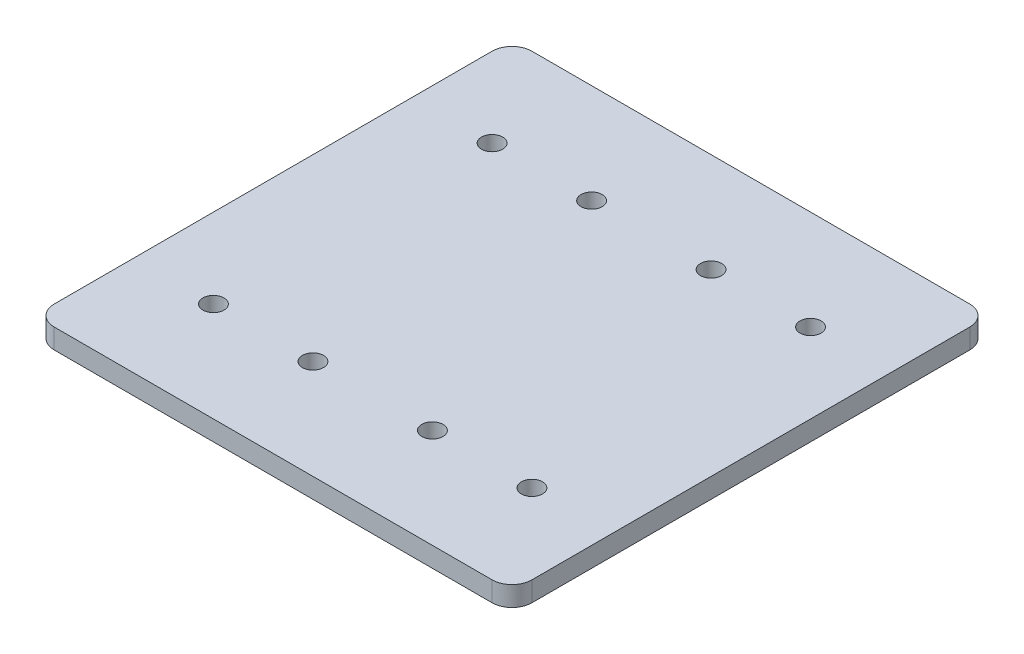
ISO-10303-21;
HEADER;
FILE_DESCRIPTION(('STEP AP214'),'2;1');
FILE_NAME('part.step','',(''),(''),'','','');
FILE_SCHEMA(('AUTOMOTIVE_DESIGN { 1 0 10303 214 1 1 1 1 }'));
ENDSEC;
DATA;
#1=APPLICATION_CONTEXT('core data for automotive mechanical design processes');
#2=APPLICATION_PROTOCOL_DEFINITION('international standard','automotive_design',2000,#1);
#3=PRODUCT_CONTEXT('',#1,'mechanical');
#4=PRODUCT('Part','Part','',(#3));
#5=PRODUCT_RELATED_PRODUCT_CATEGORY('part','',(#4));
#6=PRODUCT_DEFINITION_FORMATION('','',#4);
#7=PRODUCT_DEFINITION_CONTEXT('part definition',#1,'design');
#8=PRODUCT_DEFINITION('design','',#6,#7);
#9=PRODUCT_DEFINITION_SHAPE('','',#8);
#10=(LENGTH_UNIT() NAMED_UNIT(*) SI_UNIT(.MILLI.,.METRE.));
#11=(NAMED_UNIT(*) PLANE_ANGLE_UNIT() SI_UNIT($,.RADIAN.));
#12=(NAMED_UNIT(*) SI_UNIT($,.STERADIAN.) SOLID_ANGLE_UNIT());
#13=UNCERTAINTY_MEASURE_WITH_UNIT(LENGTH_MEASURE(1.E-05),#10,'distance_accuracy_value','');
#14=(GEOMETRIC_REPRESENTATION_CONTEXT(3) GLOBAL_UNCERTAINTY_ASSIGNED_CONTEXT((#13)) GLOBAL_UNIT_ASSIGNED_CONTEXT((#10,
#11,#12)) REPRESENTATION_CONTEXT('',''));
#15=CARTESIAN_POINT('',(0.,0.,0.));
#16=DIRECTION('',(0.,0.,1.));
#17=DIRECTION('',(1.,0.,0.));
#18=AXIS2_PLACEMENT_3D('',#15,#16,#17);
#19=CARTESIAN_POINT('',(146.05,6.34999999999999,-146.05));
#20=DIRECTION('',(0.,-1.,0.));
#21=DIRECTION('',(0.,0.,-1.));
#22=AXIS2_PLACEMENT_3D('',#19,#20,#21);
#23=PLANE('',#22);
#24=CARTESIAN_POINT('',(95.2500000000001,6.34999999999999,-120.65));
#25=DIRECTION('',(0.,1.,0.));
#26=DIRECTION('',(0.,0.,1.));
#27=AXIS2_PLACEMENT_3D('',#24,#25,#26);
#28=CIRCLE('',#27,3.37311999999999);
#29=CARTESIAN_POINT('',(95.2500000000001,6.34999999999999,-117.27688));
#30=VERTEX_POINT('',#29);
#31=EDGE_CURVE('E209',#30,#30,#28,.T.);
#32=ORIENTED_EDGE('',*,*,#31,.F.);
#33=EDGE_LOOP('',(#32));
#34=FACE_BOUND('',#33,.T.);
#35=CARTESIAN_POINT('',(127.,6.34999999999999,-31.75));
#36=DIRECTION('',(0.,1.,0.));
#37=DIRECTION('',(0.,0.,-1.));
#38=AXIS2_PLACEMENT_3D('',#35,#36,#37);
#39=CIRCLE('',#38,3.37311999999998);
#40=CARTESIAN_POINT('',(127.,6.34999999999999,-35.12312));
#41=VERTEX_POINT('',#40);
#42=EDGE_CURVE('E197',#41,#41,#39,.T.);
#43=ORIENTED_EDGE('',*,*,#42,.F.);
#44=EDGE_LOOP('',(#43));
#45=FACE_BOUND('',#44,.T.);
#46=CARTESIAN_POINT('',(25.4000000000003,6.34999999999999,-120.65));
#47=DIRECTION('',(0.,1.,0.));
#48=DIRECTION('',(0.,0.,-1.));
#49=AXIS2_PLACEMENT_3D('',#46,#47,#48);
#50=CIRCLE('',#49,3.37311999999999);
#51=CARTESIAN_POINT('',(25.4000000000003,6.34999999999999,-124.02312));
#52=VERTEX_POINT('',#51);
#53=EDGE_CURVE('E185',#52,#52,#50,.T.);
#54=ORIENTED_EDGE('',*,*,#53,.F.);
#55=EDGE_LOOP('',(#54));
#56=FACE_BOUND('',#55,.T.);
#57=CARTESIAN_POINT('',(25.4000000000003,6.34999999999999,-31.75));
#58=DIRECTION('',(0.,1.,0.));
#59=DIRECTION('',(0.,0.,1.));
#60=AXIS2_PLACEMENT_3D('',#57,#58,#59);
#61=CIRCLE('',#60,3.37312);
#62=CARTESIAN_POINT('',(25.4000000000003,6.34999999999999,-28.37688));
#63=VERTEX_POINT('',#62);
#64=EDGE_CURVE('E131',#63,#63,#61,.T.);
#65=ORIENTED_EDGE('',*,*,#64,.F.);
#66=EDGE_LOOP('',(#65));
#67=FACE_BOUND('',#66,.T.);
#68=CARTESIAN_POINT('',(146.05,6.34999999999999,-146.05));
#69=DIRECTION('',(0.,1.,0.));
#70=DIRECTION('',(0.,0.,-1.));
#71=AXIS2_PLACEMENT_3D('',#68,#69,#70);
#72=CIRCLE('',#71,6.34999999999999);
#73=CARTESIAN_POINT('',(152.4,6.34999999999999,-146.05));
#74=VERTEX_POINT('',#73);
#75=CARTESIAN_POINT('',(146.05,6.34999999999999,-152.4));
#76=VERTEX_POINT('',#75);
#77=EDGE_CURVE('E142',#74,#76,#72,.T.);
#78=ORIENTED_EDGE('',*,*,#77,.T.);
#79=DIRECTION('',(-1.,0.,0.));
#80=VECTOR('',#79,1.);
#81=CARTESIAN_POINT('',(6.3500000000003,6.34999999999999,-152.4));
#82=LINE('',#81,#80);
#83=CARTESIAN_POINT('',(6.3500000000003,6.34999999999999,-152.4));
#84=VERTEX_POINT('',#83);
#85=EDGE_CURVE('E90',#76,#84,#82,.T.);
#86=ORIENTED_EDGE('',*,*,#85,.T.);
#87=CARTESIAN_POINT('',(6.3500000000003,6.34999999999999,-146.05));
#88=DIRECTION('',(0.,1.,0.));
#89=DIRECTION('',(0.,0.,-1.));
#90=AXIS2_PLACEMENT_3D('',#87,#88,#89);
#91=CIRCLE('',#90,6.35);
#92=CARTESIAN_POINT('',(0.,6.34999999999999,-146.05));
#93=VERTEX_POINT('',#92);
#94=EDGE_CURVE('E157',#84,#93,#91,.T.);
#95=ORIENTED_EDGE('',*,*,#94,.T.);
#96=DIRECTION('',(0.,0.,1.));
#97=VECTOR('',#96,1.);
#98=CARTESIAN_POINT('',(0.,6.34999999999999,-6.35000000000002));
#99=LINE('',#98,#97);
#100=CARTESIAN_POINT('',(0.,6.34999999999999,-6.35000000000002));
#101=VERTEX_POINT('',#100);
#102=EDGE_CURVE('E170',#93,#101,#99,.T.);
#103=ORIENTED_EDGE('',*,*,#102,.T.);
#104=CARTESIAN_POINT('',(6.3500000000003,6.34999999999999,-6.35000000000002));
#105=DIRECTION('',(0.,1.,0.));
#106=DIRECTION('',(0.,0.,1.));
#107=AXIS2_PLACEMENT_3D('',#104,#105,#106);
#108=CIRCLE('',#107,6.35);
#109=CARTESIAN_POINT('',(6.3500000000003,6.34999999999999,0.));
#110=VERTEX_POINT('',#109);
#111=EDGE_CURVE('E109',#101,#110,#108,.T.);
#112=ORIENTED_EDGE('',*,*,#111,.T.);
#113=DIRECTION('',(1.,0.,0.));
#114=VECTOR('',#113,1.);
#115=CARTESIAN_POINT('',(6.3500000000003,6.34999999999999,0.));
#116=LINE('',#115,#114);
#117=CARTESIAN_POINT('',(146.05,6.34999999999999,0.));
#118=VERTEX_POINT('',#117);
#119=EDGE_CURVE('E103',#110,#118,#116,.T.);
#120=ORIENTED_EDGE('',*,*,#119,.T.);
#121=CARTESIAN_POINT('',(146.05,6.34999999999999,-6.35000000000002));
#122=DIRECTION('',(0.,1.,0.));
#123=DIRECTION('',(0.,0.,-1.));
#124=AXIS2_PLACEMENT_3D('',#121,#122,#123);
#125=CIRCLE('',#124,6.35);
#126=CARTESIAN_POINT('',(152.4,6.34999999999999,-6.35000000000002));
#127=VERTEX_POINT('',#126);
#128=EDGE_CURVE('E107',#118,#127,#125,.T.);
#129=ORIENTED_EDGE('',*,*,#128,.T.);
#130=DIRECTION('',(0.,0.,-1.));
#131=VECTOR('',#130,1.);
#132=CARTESIAN_POINT('',(152.4,6.34999999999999,-6.35000000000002));
#133=LINE('',#132,#131);
#134=EDGE_CURVE('E47',#127,#74,#133,.T.);
#135=ORIENTED_EDGE('',*,*,#134,.T.);
#136=EDGE_LOOP('',(#78,#86,#95,#103,#112,#120,#129,#135));
#137=FACE_BOUND('',#136,.T.);
#138=CARTESIAN_POINT('',(57.15,6.34999999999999,-31.75));
#139=DIRECTION('',(0.,1.,0.));
#140=DIRECTION('',(0.,0.,1.));
#141=AXIS2_PLACEMENT_3D('',#138,#139,#140);
#142=CIRCLE('',#141,3.37312);
#143=CARTESIAN_POINT('',(57.15,6.34999999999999,-28.37688));
#144=VERTEX_POINT('',#143);
#145=EDGE_CURVE('E179',#144,#144,#142,.T.);
#146=ORIENTED_EDGE('',*,*,#145,.F.);
#147=EDGE_LOOP('',(#146));
#148=FACE_BOUND('',#147,.T.);
#149=CARTESIAN_POINT('',(57.15,6.34999999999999,-120.65));
#150=DIRECTION('',(0.,1.,0.));
#151=DIRECTION('',(0.,0.,-1.));
#152=AXIS2_PLACEMENT_3D('',#149,#150,#151);
#153=CIRCLE('',#152,3.37311999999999);
#154=CARTESIAN_POINT('',(57.15,6.34999999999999,-124.02312));
#155=VERTEX_POINT('',#154);
#156=EDGE_CURVE('E191',#155,#155,#153,.T.);
#157=ORIENTED_EDGE('',*,*,#156,.F.);
#158=EDGE_LOOP('',(#157));
#159=FACE_BOUND('',#158,.T.);
#160=CARTESIAN_POINT('',(127.,6.34999999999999,-120.65));
#161=DIRECTION('',(0.,1.,0.));
#162=DIRECTION('',(0.,0.,1.));
#163=AXIS2_PLACEMENT_3D('',#160,#161,#162);
#164=CIRCLE('',#163,3.37311999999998);
#165=CARTESIAN_POINT('',(127.,6.34999999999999,-117.27688));
#166=VERTEX_POINT('',#165);
#167=EDGE_CURVE('E203',#166,#166,#164,.T.);
#168=ORIENTED_EDGE('',*,*,#167,.F.);
#169=EDGE_LOOP('',(#168));
#170=FACE_BOUND('',#169,.T.);
#171=CARTESIAN_POINT('',(95.2500000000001,6.34999999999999,-31.75));
#172=DIRECTION('',(0.,1.,0.));
#173=DIRECTION('',(0.,0.,-1.));
#174=AXIS2_PLACEMENT_3D('',#171,#172,#173);
#175=CIRCLE('',#174,3.37312);
#176=CARTESIAN_POINT('',(95.2500000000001,6.34999999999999,-35.12312));
#177=VERTEX_POINT('',#176);
#178=EDGE_CURVE('E215',#177,#177,#175,.T.);
#179=ORIENTED_EDGE('',*,*,#178,.F.);
#180=EDGE_LOOP('',(#179));
#181=FACE_BOUND('',#180,.T.);
#182=ADVANCED_FACE('F30',(#34,#45,#56,#67,#137,#148,#159,#170,#181),#23,.F.);
#183=CARTESIAN_POINT('',(146.05,0.,-146.05));
#184=DIRECTION('',(0.,-1.,0.));
#185=DIRECTION('',(0.,0.,-1.));
#186=AXIS2_PLACEMENT_3D('',#183,#184,#185);
#187=PLANE('',#186);
#188=CARTESIAN_POINT('',(95.2500000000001,0.,-120.65));
#189=DIRECTION('',(0.,1.,0.));
#190=DIRECTION('',(0.,0.,1.));
#191=AXIS2_PLACEMENT_3D('',#188,#189,#190);
#192=CIRCLE('',#191,3.37311999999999);
#193=CARTESIAN_POINT('',(95.2500000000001,0.,-117.27688));
#194=VERTEX_POINT('',#193);
#195=EDGE_CURVE('E212',#194,#194,#192,.T.);
#196=ORIENTED_EDGE('',*,*,#195,.T.);
#197=EDGE_LOOP('',(#196));
#198=FACE_BOUND('',#197,.T.);
#199=CARTESIAN_POINT('',(127.,0.,-31.75));
#200=DIRECTION('',(0.,1.,0.));
#201=DIRECTION('',(0.,0.,-1.));
#202=AXIS2_PLACEMENT_3D('',#199,#200,#201);
#203=CIRCLE('',#202,3.37311999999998);
#204=CARTESIAN_POINT('',(127.,0.,-35.12312));
#205=VERTEX_POINT('',#204);
#206=EDGE_CURVE('E200',#205,#205,#203,.T.);
#207=ORIENTED_EDGE('',*,*,#206,.T.);
#208=EDGE_LOOP('',(#207));
#209=FACE_BOUND('',#208,.T.);
#210=CARTESIAN_POINT('',(25.4000000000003,0.,-120.65));
#211=DIRECTION('',(0.,1.,0.));
#212=DIRECTION('',(0.,0.,-1.));
#213=AXIS2_PLACEMENT_3D('',#210,#211,#212);
#214=CIRCLE('',#213,3.37311999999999);
#215=CARTESIAN_POINT('',(25.4000000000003,0.,-124.02312));
#216=VERTEX_POINT('',#215);
#217=EDGE_CURVE('E188',#216,#216,#214,.T.);
#218=ORIENTED_EDGE('',*,*,#217,.T.);
#219=EDGE_LOOP('',(#218));
#220=FACE_BOUND('',#219,.T.);
#221=CARTESIAN_POINT('',(25.4000000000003,0.,-31.75));
#222=DIRECTION('',(0.,1.,0.));
#223=DIRECTION('',(0.,0.,1.));
#224=AXIS2_PLACEMENT_3D('',#221,#222,#223);
#225=CIRCLE('',#224,3.37312);
#226=CARTESIAN_POINT('',(25.4000000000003,0.,-28.37688));
#227=VERTEX_POINT('',#226);
#228=EDGE_CURVE('E176',#227,#227,#225,.T.);
#229=ORIENTED_EDGE('',*,*,#228,.T.);
#230=EDGE_LOOP('',(#229));
#231=FACE_BOUND('',#230,.T.);
#232=CARTESIAN_POINT('',(146.05,0.,-146.05));
#233=DIRECTION('',(0.,1.,0.));
#234=DIRECTION('',(0.,0.,-1.));
#235=AXIS2_PLACEMENT_3D('',#232,#233,#234);
#236=CIRCLE('',#235,6.34999999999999);
#237=CARTESIAN_POINT('',(152.4,0.,-146.05));
#238=VERTEX_POINT('',#237);
#239=CARTESIAN_POINT('',(146.05,0.,-152.4));
#240=VERTEX_POINT('',#239);
#241=EDGE_CURVE('E127',#238,#240,#236,.T.);
#242=ORIENTED_EDGE('',*,*,#241,.F.);
#243=DIRECTION('',(0.,0.,-1.));
#244=VECTOR('',#243,1.);
#245=CARTESIAN_POINT('',(152.4,0.,-6.35000000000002));
#246=LINE('',#245,#244);
#247=CARTESIAN_POINT('',(152.4,0.,-6.35000000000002));
#248=VERTEX_POINT('',#247);
#249=EDGE_CURVE('E82',#248,#238,#246,.T.);
#250=ORIENTED_EDGE('',*,*,#249,.F.);
#251=CARTESIAN_POINT('',(146.05,0.,-6.35000000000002));
#252=DIRECTION('',(0.,1.,0.));
#253=DIRECTION('',(0.,0.,-1.));
#254=AXIS2_PLACEMENT_3D('',#251,#252,#253);
#255=CIRCLE('',#254,6.35);
#256=CARTESIAN_POINT('',(146.05,0.,0.));
#257=VERTEX_POINT('',#256);
#258=EDGE_CURVE('E76',#257,#248,#255,.T.);
#259=ORIENTED_EDGE('',*,*,#258,.F.);
#260=DIRECTION('',(1.,0.,0.));
#261=VECTOR('',#260,1.);
#262=CARTESIAN_POINT('',(6.3500000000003,0.,0.));
#263=LINE('',#262,#261);
#264=CARTESIAN_POINT('',(6.3500000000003,0.,0.));
#265=VERTEX_POINT('',#264);
#266=EDGE_CURVE('E117',#265,#257,#263,.T.);
#267=ORIENTED_EDGE('',*,*,#266,.F.);
#268=CARTESIAN_POINT('',(6.3500000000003,0.,-6.35000000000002));
#269=DIRECTION('',(0.,1.,0.));
#270=DIRECTION('',(0.,0.,1.));
#271=AXIS2_PLACEMENT_3D('',#268,#269,#270);
#272=CIRCLE('',#271,6.35);
#273=CARTESIAN_POINT('',(0.,0.,-6.35000000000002));
#274=VERTEX_POINT('',#273);
#275=EDGE_CURVE('E137',#274,#265,#272,.T.);
#276=ORIENTED_EDGE('',*,*,#275,.F.);
#277=DIRECTION('',(0.,0.,1.));
#278=VECTOR('',#277,1.);
#279=CARTESIAN_POINT('',(0.,0.,-6.35000000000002));
#280=LINE('',#279,#278);
#281=CARTESIAN_POINT('',(0.,0.,-146.05));
#282=VERTEX_POINT('',#281);
#283=EDGE_CURVE('E135',#282,#274,#280,.T.);
#284=ORIENTED_EDGE('',*,*,#283,.F.);
#285=CARTESIAN_POINT('',(6.3500000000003,0.,-146.05));
#286=DIRECTION('',(0.,1.,0.));
#287=DIRECTION('',(0.,0.,-1.));
#288=AXIS2_PLACEMENT_3D('',#285,#286,#287);
#289=CIRCLE('',#288,6.35);
#290=CARTESIAN_POINT('',(6.3500000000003,0.,-152.4));
#291=VERTEX_POINT('',#290);
#292=EDGE_CURVE('E133',#291,#282,#289,.T.);
#293=ORIENTED_EDGE('',*,*,#292,.F.);
#294=DIRECTION('',(-1.,0.,0.));
#295=VECTOR('',#294,1.);
#296=CARTESIAN_POINT('',(6.3500000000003,0.,-152.4));
#297=LINE('',#296,#295);
#298=EDGE_CURVE('E130',#240,#291,#297,.T.);
#299=ORIENTED_EDGE('',*,*,#298,.F.);
#300=EDGE_LOOP('',(#242,#250,#259,#267,#276,#284,#293,#299));
#301=FACE_BOUND('',#300,.T.);
#302=CARTESIAN_POINT('',(57.15,0.,-31.75));
#303=DIRECTION('',(0.,1.,0.));
#304=DIRECTION('',(0.,0.,1.));
#305=AXIS2_PLACEMENT_3D('',#302,#303,#304);
#306=CIRCLE('',#305,3.37312);
#307=CARTESIAN_POINT('',(57.15,0.,-28.37688));
#308=VERTEX_POINT('',#307);
#309=EDGE_CURVE('E182',#308,#308,#306,.T.);
#310=ORIENTED_EDGE('',*,*,#309,.T.);
#311=EDGE_LOOP('',(#310));
#312=FACE_BOUND('',#311,.T.);
#313=CARTESIAN_POINT('',(57.15,0.,-120.65));
#314=DIRECTION('',(0.,1.,0.));
#315=DIRECTION('',(0.,0.,-1.));
#316=AXIS2_PLACEMENT_3D('',#313,#314,#315);
#317=CIRCLE('',#316,3.37311999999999);
#318=CARTESIAN_POINT('',(57.15,0.,-124.02312));
#319=VERTEX_POINT('',#318);
#320=EDGE_CURVE('E194',#319,#319,#317,.T.);
#321=ORIENTED_EDGE('',*,*,#320,.T.);
#322=EDGE_LOOP('',(#321));
#323=FACE_BOUND('',#322,.T.);
#324=CARTESIAN_POINT('',(127.,0.,-120.65));
#325=DIRECTION('',(0.,1.,0.));
#326=DIRECTION('',(0.,0.,1.));
#327=AXIS2_PLACEMENT_3D('',#324,#325,#326);
#328=CIRCLE('',#327,3.37311999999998);
#329=CARTESIAN_POINT('',(127.,0.,-117.27688));
#330=VERTEX_POINT('',#329);
#331=EDGE_CURVE('E206',#330,#330,#328,.T.);
#332=ORIENTED_EDGE('',*,*,#331,.T.);
#333=EDGE_LOOP('',(#332));
#334=FACE_BOUND('',#333,.T.);
#335=CARTESIAN_POINT('',(95.2500000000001,0.,-31.75));
#336=DIRECTION('',(0.,1.,0.));
#337=DIRECTION('',(0.,0.,-1.));
#338=AXIS2_PLACEMENT_3D('',#335,#336,#337);
#339=CIRCLE('',#338,3.37312);
#340=CARTESIAN_POINT('',(95.2500000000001,0.,-35.12312));
#341=VERTEX_POINT('',#340);
#342=EDGE_CURVE('E218',#341,#341,#339,.T.);
#343=ORIENTED_EDGE('',*,*,#342,.T.);
#344=EDGE_LOOP('',(#343));
#345=FACE_BOUND('',#344,.T.);
#346=ADVANCED_FACE('F161',(#198,#209,#220,#231,#301,#312,#323,#334,#345),#187,.T.);
#347=CARTESIAN_POINT('',(146.05,6.34999999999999,-146.05));
#348=DIRECTION('',(0.,-1.,0.));
#349=DIRECTION('',(0.,0.,-1.));
#350=AXIS2_PLACEMENT_3D('',#347,#348,#349);
#351=CYLINDRICAL_SURFACE('',#350,6.34999999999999);
#352=ORIENTED_EDGE('',*,*,#241,.T.);
#353=DIRECTION('',(0.,-1.,0.));
#354=VECTOR('',#353,1.);
#355=CARTESIAN_POINT('',(146.05,6.34999999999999,-152.4));
#356=LINE('',#355,#354);
#357=EDGE_CURVE('E11',#76,#240,#356,.T.);
#358=ORIENTED_EDGE('',*,*,#357,.F.);
#359=ORIENTED_EDGE('',*,*,#77,.F.);
#360=DIRECTION('',(0.,-1.,0.));
#361=VECTOR('',#360,1.);
#362=CARTESIAN_POINT('',(152.4,6.34999999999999,-146.05));
#363=LINE('',#362,#361);
#364=EDGE_CURVE('E123',#74,#238,#363,.T.);
#365=ORIENTED_EDGE('',*,*,#364,.T.);
#366=EDGE_LOOP('',(#352,#358,#359,#365));
#367=FACE_BOUND('',#366,.T.);
#368=ADVANCED_FACE('F32',(#367),#351,.T.);
#369=CARTESIAN_POINT('',(6.3500000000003,6.34999999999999,-152.4));
#370=DIRECTION('',(0.,0.,1.));
#371=DIRECTION('',(1.,0.,0.));
#372=AXIS2_PLACEMENT_3D('',#369,#370,#371);
#373=PLANE('',#372);
#374=ORIENTED_EDGE('',*,*,#298,.T.);
#375=DIRECTION('',(0.,-1.,0.));
#376=VECTOR('',#375,1.);
#377=CARTESIAN_POINT('',(6.3500000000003,6.34999999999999,-152.4));
#378=LINE('',#377,#376);
#379=EDGE_CURVE('E39',#84,#291,#378,.T.);
#380=ORIENTED_EDGE('',*,*,#379,.F.);
#381=ORIENTED_EDGE('',*,*,#85,.F.);
#382=ORIENTED_EDGE('',*,*,#357,.T.);
#383=EDGE_LOOP('',(#374,#380,#381,#382));
#384=FACE_BOUND('',#383,.T.);
#385=ADVANCED_FACE('F253',(#384),#373,.F.);
#386=CARTESIAN_POINT('',(6.3500000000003,6.34999999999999,-146.05));
#387=DIRECTION('',(0.,-1.,0.));
#388=DIRECTION('',(0.,0.,-1.));
#389=AXIS2_PLACEMENT_3D('',#386,#387,#388);
#390=CYLINDRICAL_SURFACE('',#389,6.35);
#391=ORIENTED_EDGE('',*,*,#292,.T.);
#392=DIRECTION('',(0.,-1.,0.));
#393=VECTOR('',#392,1.);
#394=CARTESIAN_POINT('',(0.,6.34999999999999,-146.05));
#395=LINE('',#394,#393);
#396=EDGE_CURVE('E149',#93,#282,#395,.T.);
#397=ORIENTED_EDGE('',*,*,#396,.F.);
#398=ORIENTED_EDGE('',*,*,#94,.F.);
#399=ORIENTED_EDGE('',*,*,#379,.T.);
#400=EDGE_LOOP('',(#391,#397,#398,#399));
#401=FACE_BOUND('',#400,.T.);
#402=ADVANCED_FACE('F155',(#401),#390,.T.);
#403=CARTESIAN_POINT('',(0.,6.34999999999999,-6.35000000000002));
#404=DIRECTION('',(1.,0.,0.));
#405=DIRECTION('',(0.,0.,-1.));
#406=AXIS2_PLACEMENT_3D('',#403,#404,#405);
#407=PLANE('',#406);
#408=ORIENTED_EDGE('',*,*,#283,.T.);
#409=DIRECTION('',(0.,-1.,0.));
#410=VECTOR('',#409,1.);
#411=CARTESIAN_POINT('',(0.,6.34999999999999,-6.35000000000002));
#412=LINE('',#411,#410);
#413=EDGE_CURVE('E146',#101,#274,#412,.T.);
#414=ORIENTED_EDGE('',*,*,#413,.F.);
#415=ORIENTED_EDGE('',*,*,#102,.F.);
#416=ORIENTED_EDGE('',*,*,#396,.T.);
#417=EDGE_LOOP('',(#408,#414,#415,#416));
#418=FACE_BOUND('',#417,.T.);
#419=ADVANCED_FACE('F166',(#418),#407,.F.);
#420=CARTESIAN_POINT('',(6.3500000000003,6.34999999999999,-6.35000000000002));
#421=DIRECTION('',(0.,-1.,0.));
#422=DIRECTION('',(0.,0.,-1.));
#423=AXIS2_PLACEMENT_3D('',#420,#421,#422);
#424=CYLINDRICAL_SURFACE('',#423,6.35);
#425=ORIENTED_EDGE('',*,*,#275,.T.);
#426=DIRECTION('',(0.,-1.,0.));
#427=VECTOR('',#426,1.);
#428=CARTESIAN_POINT('',(6.3500000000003,6.34999999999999,0.));
#429=LINE('',#428,#427);
#430=EDGE_CURVE('E118',#110,#265,#429,.T.);
#431=ORIENTED_EDGE('',*,*,#430,.F.);
#432=ORIENTED_EDGE('',*,*,#111,.F.);
#433=ORIENTED_EDGE('',*,*,#413,.T.);
#434=EDGE_LOOP('',(#425,#431,#432,#433));
#435=FACE_BOUND('',#434,.T.);
#436=ADVANCED_FACE('F169',(#435),#424,.T.);
#437=CARTESIAN_POINT('',(6.3500000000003,6.34999999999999,0.));
#438=DIRECTION('',(0.,0.,-1.));
#439=DIRECTION('',(-1.,0.,0.));
#440=AXIS2_PLACEMENT_3D('',#437,#438,#439);
#441=PLANE('',#440);
#442=ORIENTED_EDGE('',*,*,#266,.T.);
#443=DIRECTION('',(0.,-1.,0.));
#444=VECTOR('',#443,1.);
#445=CARTESIAN_POINT('',(146.05,6.34999999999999,0.));
#446=LINE('',#445,#444);
#447=EDGE_CURVE('E114',#118,#257,#446,.T.);
#448=ORIENTED_EDGE('',*,*,#447,.F.);
#449=ORIENTED_EDGE('',*,*,#119,.F.);
#450=ORIENTED_EDGE('',*,*,#430,.T.);
#451=EDGE_LOOP('',(#442,#448,#449,#450));
#452=FACE_BOUND('',#451,.T.);
#453=ADVANCED_FACE('F115',(#452),#441,.F.);
#454=CARTESIAN_POINT('',(146.05,6.34999999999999,-6.35000000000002));
#455=DIRECTION('',(0.,-1.,0.));
#456=DIRECTION('',(0.,0.,-1.));
#457=AXIS2_PLACEMENT_3D('',#454,#455,#456);
#458=CYLINDRICAL_SURFACE('',#457,6.35);
#459=ORIENTED_EDGE('',*,*,#258,.T.);
#460=DIRECTION('',(0.,-1.,0.));
#461=VECTOR('',#460,1.);
#462=CARTESIAN_POINT('',(152.4,6.34999999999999,-6.35000000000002));
#463=LINE('',#462,#461);
#464=EDGE_CURVE('E119',#127,#248,#463,.T.);
#465=ORIENTED_EDGE('',*,*,#464,.F.);
#466=ORIENTED_EDGE('',*,*,#128,.F.);
#467=ORIENTED_EDGE('',*,*,#447,.T.);
#468=EDGE_LOOP('',(#459,#465,#466,#467));
#469=FACE_BOUND('',#468,.T.);
#470=ADVANCED_FACE('F121',(#469),#458,.T.);
#471=CARTESIAN_POINT('',(152.4,6.34999999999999,-6.35000000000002));
#472=DIRECTION('',(-1.,0.,0.));
#473=DIRECTION('',(0.,0.,1.));
#474=AXIS2_PLACEMENT_3D('',#471,#472,#473);
#475=PLANE('',#474);
#476=ORIENTED_EDGE('',*,*,#249,.T.);
#477=ORIENTED_EDGE('',*,*,#364,.F.);
#478=ORIENTED_EDGE('',*,*,#134,.F.);
#479=ORIENTED_EDGE('',*,*,#464,.T.);
#480=EDGE_LOOP('',(#476,#477,#478,#479));
#481=FACE_BOUND('',#480,.T.);
#482=ADVANCED_FACE('F241',(#481),#475,.F.);
#483=CARTESIAN_POINT('',(25.4000000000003,6.34999999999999,-31.75));
#484=DIRECTION('',(0.,-1.,0.));
#485=DIRECTION('',(0.,0.,-1.));
#486=AXIS2_PLACEMENT_3D('',#483,#484,#485);
#487=CYLINDRICAL_SURFACE('',#486,3.37312);
#488=ORIENTED_EDGE('',*,*,#64,.T.);
#489=EDGE_LOOP('',(#488));
#490=FACE_BOUND('',#489,.T.);
#491=ORIENTED_EDGE('',*,*,#228,.F.);
#492=EDGE_LOOP('',(#491));
#493=FACE_BOUND('',#492,.T.);
#494=ADVANCED_FACE('F238',(#490,#493),#487,.F.);
#495=CARTESIAN_POINT('',(57.15,6.34999999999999,-31.75));
#496=DIRECTION('',(0.,-1.,0.));
#497=DIRECTION('',(0.,0.,-1.));
#498=AXIS2_PLACEMENT_3D('',#495,#496,#497);
#499=CYLINDRICAL_SURFACE('',#498,3.37312);
#500=ORIENTED_EDGE('',*,*,#145,.T.);
#501=EDGE_LOOP('',(#500));
#502=FACE_BOUND('',#501,.T.);
#503=ORIENTED_EDGE('',*,*,#309,.F.);
#504=EDGE_LOOP('',(#503));
#505=FACE_BOUND('',#504,.T.);
#506=ADVANCED_FACE('F302',(#502,#505),#499,.F.);
#507=CARTESIAN_POINT('',(25.4000000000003,6.34999999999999,-120.65));
#508=DIRECTION('',(0.,-1.,0.));
#509=DIRECTION('',(0.,0.,-1.));
#510=AXIS2_PLACEMENT_3D('',#507,#508,#509);
#511=CYLINDRICAL_SURFACE('',#510,3.37311999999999);
#512=ORIENTED_EDGE('',*,*,#53,.T.);
#513=EDGE_LOOP('',(#512));
#514=FACE_BOUND('',#513,.T.);
#515=ORIENTED_EDGE('',*,*,#217,.F.);
#516=EDGE_LOOP('',(#515));
#517=FACE_BOUND('',#516,.T.);
#518=ADVANCED_FACE('F309',(#514,#517),#511,.F.);
#519=CARTESIAN_POINT('',(57.15,6.34999999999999,-120.65));
#520=DIRECTION('',(0.,-1.,0.));
#521=DIRECTION('',(0.,0.,-1.));
#522=AXIS2_PLACEMENT_3D('',#519,#520,#521);
#523=CYLINDRICAL_SURFACE('',#522,3.37311999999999);
#524=ORIENTED_EDGE('',*,*,#156,.T.);
#525=EDGE_LOOP('',(#524));
#526=FACE_BOUND('',#525,.T.);
#527=ORIENTED_EDGE('',*,*,#320,.F.);
#528=EDGE_LOOP('',(#527));
#529=FACE_BOUND('',#528,.T.);
#530=ADVANCED_FACE('F316',(#526,#529),#523,.F.);
#531=CARTESIAN_POINT('',(127.,6.34999999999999,-31.75));
#532=DIRECTION('',(0.,-1.,0.));
#533=DIRECTION('',(0.,0.,-1.));
#534=AXIS2_PLACEMENT_3D('',#531,#532,#533);
#535=CYLINDRICAL_SURFACE('',#534,3.37311999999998);
#536=ORIENTED_EDGE('',*,*,#42,.T.);
#537=EDGE_LOOP('',(#536));
#538=FACE_BOUND('',#537,.T.);
#539=ORIENTED_EDGE('',*,*,#206,.F.);
#540=EDGE_LOOP('',(#539));
#541=FACE_BOUND('',#540,.T.);
#542=ADVANCED_FACE('F324',(#538,#541),#535,.F.);
#543=CARTESIAN_POINT('',(127.,6.34999999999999,-120.65));
#544=DIRECTION('',(0.,-1.,0.));
#545=DIRECTION('',(0.,0.,-1.));
#546=AXIS2_PLACEMENT_3D('',#543,#544,#545);
#547=CYLINDRICAL_SURFACE('',#546,3.37311999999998);
#548=ORIENTED_EDGE('',*,*,#167,.T.);
#549=EDGE_LOOP('',(#548));
#550=FACE_BOUND('',#549,.T.);
#551=ORIENTED_EDGE('',*,*,#331,.F.);
#552=EDGE_LOOP('',(#551));
#553=FACE_BOUND('',#552,.T.);
#554=ADVANCED_FACE('F332',(#550,#553),#547,.F.);
#555=CARTESIAN_POINT('',(95.2500000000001,6.34999999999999,-120.65));
#556=DIRECTION('',(0.,-1.,0.));
#557=DIRECTION('',(0.,0.,-1.));
#558=AXIS2_PLACEMENT_3D('',#555,#556,#557);
#559=CYLINDRICAL_SURFACE('',#558,3.37311999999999);
#560=ORIENTED_EDGE('',*,*,#31,.T.);
#561=EDGE_LOOP('',(#560));
#562=FACE_BOUND('',#561,.T.);
#563=ORIENTED_EDGE('',*,*,#195,.F.);
#564=EDGE_LOOP('',(#563));
#565=FACE_BOUND('',#564,.T.);
#566=ADVANCED_FACE('F340',(#562,#565),#559,.F.);
#567=CARTESIAN_POINT('',(95.2500000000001,6.34999999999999,-31.75));
#568=DIRECTION('',(0.,-1.,0.));
#569=DIRECTION('',(0.,0.,-1.));
#570=AXIS2_PLACEMENT_3D('',#567,#568,#569);
#571=CYLINDRICAL_SURFACE('',#570,3.37312);
#572=ORIENTED_EDGE('',*,*,#178,.T.);
#573=EDGE_LOOP('',(#572));
#574=FACE_BOUND('',#573,.T.);
#575=ORIENTED_EDGE('',*,*,#342,.F.);
#576=EDGE_LOOP('',(#575));
#577=FACE_BOUND('',#576,.T.);
#578=ADVANCED_FACE('F224',(#574,#577),#571,.F.);
#579=CLOSED_SHELL('',(#182,#346,#368,#385,#402,#419,#436,#453,#470,#482,#494,#506,#518,#530,
#542,#554,#566,#578));
#580=MANIFOLD_SOLID_BREP('B2',#579);
#581=ADVANCED_BREP_SHAPE_REPRESENTATION('',(#18,#580),#14);
#582=SHAPE_DEFINITION_REPRESENTATION(#9,#581);
ENDSEC;
END-ISO-10303-21;
